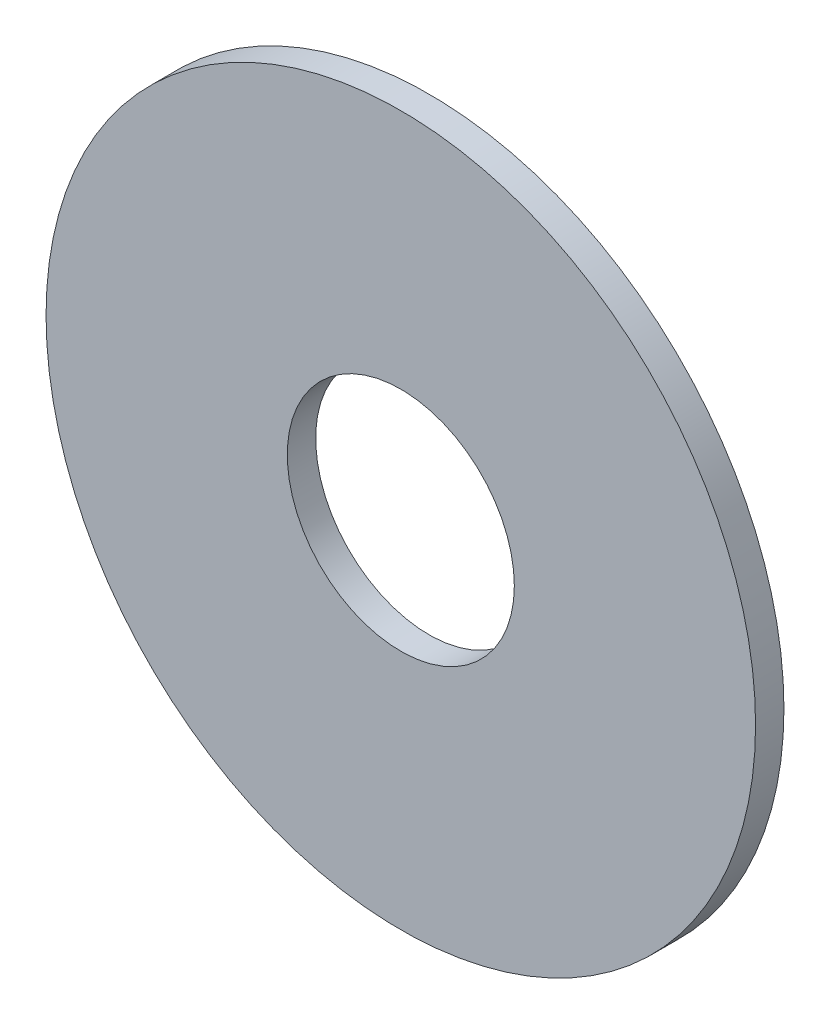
ISO-10303-21;
HEADER;
FILE_DESCRIPTION(('STEP AP214'),'2;1');
FILE_NAME('part.step','',(''),(''),'','','');
FILE_SCHEMA(('AUTOMOTIVE_DESIGN { 1 0 10303 214 1 1 1 1 }'));
ENDSEC;
DATA;
#1=APPLICATION_CONTEXT('core data for automotive mechanical design processes');
#2=APPLICATION_PROTOCOL_DEFINITION('international standard','automotive_design',2000,#1);
#3=PRODUCT_CONTEXT('',#1,'mechanical');
#4=PRODUCT('Part','Part','',(#3));
#5=PRODUCT_RELATED_PRODUCT_CATEGORY('part','',(#4));
#6=PRODUCT_DEFINITION_FORMATION('','',#4);
#7=PRODUCT_DEFINITION_CONTEXT('part definition',#1,'design');
#8=PRODUCT_DEFINITION('design','',#6,#7);
#9=PRODUCT_DEFINITION_SHAPE('','',#8);
#10=(LENGTH_UNIT() NAMED_UNIT(*) SI_UNIT(.MILLI.,.METRE.));
#11=(NAMED_UNIT(*) PLANE_ANGLE_UNIT() SI_UNIT($,.RADIAN.));
#12=(NAMED_UNIT(*) SI_UNIT($,.STERADIAN.) SOLID_ANGLE_UNIT());
#13=UNCERTAINTY_MEASURE_WITH_UNIT(LENGTH_MEASURE(1.E-05),#10,'distance_accuracy_value','');
#14=(GEOMETRIC_REPRESENTATION_CONTEXT(3) GLOBAL_UNCERTAINTY_ASSIGNED_CONTEXT((#13)) GLOBAL_UNIT_ASSIGNED_CONTEXT((#10,
#11,#12)) REPRESENTATION_CONTEXT('',''));
#15=CARTESIAN_POINT('',(0.,0.,0.));
#16=DIRECTION('',(0.,0.,1.));
#17=DIRECTION('',(1.,0.,0.));
#18=AXIS2_PLACEMENT_3D('',#15,#16,#17);
#19=CARTESIAN_POINT('',(0.,0.,-1.));
#20=DIRECTION('',(0.,0.,1.));
#21=DIRECTION('',(1.,0.,0.));
#22=AXIS2_PLACEMENT_3D('',#19,#20,#21);
#23=CYLINDRICAL_SURFACE('',#22,12.5);
#24=CARTESIAN_POINT('',(0.,0.,-1.));
#25=DIRECTION('',(0.,0.,1.));
#26=DIRECTION('',(1.,0.,0.));
#27=AXIS2_PLACEMENT_3D('',#24,#25,#26);
#28=CIRCLE('',#27,12.5);
#29=CARTESIAN_POINT('',(12.5,0.,-1.));
#30=VERTEX_POINT('',#29);
#31=EDGE_CURVE('E10',#30,#30,#28,.T.);
#32=ORIENTED_EDGE('',*,*,#31,.T.);
#33=EDGE_LOOP('',(#32));
#34=FACE_BOUND('',#33,.T.);
#35=CARTESIAN_POINT('',(0.,0.,0.));
#36=DIRECTION('',(0.,0.,1.));
#37=DIRECTION('',(1.,0.,0.));
#38=AXIS2_PLACEMENT_3D('',#35,#36,#37);
#39=CIRCLE('',#38,12.5);
#40=CARTESIAN_POINT('',(12.5,0.,0.));
#41=VERTEX_POINT('',#40);
#42=EDGE_CURVE('E34',#41,#41,#39,.T.);
#43=ORIENTED_EDGE('',*,*,#42,.F.);
#44=EDGE_LOOP('',(#43));
#45=FACE_BOUND('',#44,.T.);
#46=ADVANCED_FACE('F31',(#34,#45),#23,.T.);
#47=CARTESIAN_POINT('',(0.,0.,-1.));
#48=DIRECTION('',(0.,0.,1.));
#49=DIRECTION('',(1.,0.,0.));
#50=AXIS2_PLACEMENT_3D('',#47,#48,#49);
#51=PLANE('',#50);
#52=CARTESIAN_POINT('',(0.,0.,-1.));
#53=DIRECTION('',(0.,0.,1.));
#54=DIRECTION('',(1.,0.,0.));
#55=AXIS2_PLACEMENT_3D('',#52,#53,#54);
#56=CIRCLE('',#55,4.);
#57=CARTESIAN_POINT('',(4.,0.,-1.));
#58=VERTEX_POINT('',#57);
#59=EDGE_CURVE('E41',#58,#58,#56,.T.);
#60=ORIENTED_EDGE('',*,*,#59,.T.);
#61=EDGE_LOOP('',(#60));
#62=FACE_BOUND('',#61,.T.);
#63=ORIENTED_EDGE('',*,*,#31,.F.);
#64=EDGE_LOOP('',(#63));
#65=FACE_BOUND('',#64,.T.);
#66=ADVANCED_FACE('F49',(#62,#65),#51,.F.);
#67=CARTESIAN_POINT('',(0.,0.,0.));
#68=DIRECTION('',(0.,0.,1.));
#69=DIRECTION('',(1.,0.,0.));
#70=AXIS2_PLACEMENT_3D('',#67,#68,#69);
#71=PLANE('',#70);
#72=CARTESIAN_POINT('',(0.,0.,0.));
#73=DIRECTION('',(0.,0.,1.));
#74=DIRECTION('',(1.,0.,0.));
#75=AXIS2_PLACEMENT_3D('',#72,#73,#74);
#76=CIRCLE('',#75,4.);
#77=CARTESIAN_POINT('',(4.,0.,0.));
#78=VERTEX_POINT('',#77);
#79=EDGE_CURVE('E43',#78,#78,#76,.T.);
#80=ORIENTED_EDGE('',*,*,#79,.F.);
#81=EDGE_LOOP('',(#80));
#82=FACE_BOUND('',#81,.T.);
#83=ORIENTED_EDGE('',*,*,#42,.T.);
#84=EDGE_LOOP('',(#83));
#85=FACE_BOUND('',#84,.T.);
#86=ADVANCED_FACE('F55',(#82,#85),#71,.T.);
#87=CARTESIAN_POINT('',(0.,0.,-1.));
#88=DIRECTION('',(0.,0.,1.));
#89=DIRECTION('',(1.,0.,0.));
#90=AXIS2_PLACEMENT_3D('',#87,#88,#89);
#91=CYLINDRICAL_SURFACE('',#90,4.);
#92=ORIENTED_EDGE('',*,*,#59,.F.);
#93=EDGE_LOOP('',(#92));
#94=FACE_BOUND('',#93,.T.);
#95=ORIENTED_EDGE('',*,*,#79,.T.);
#96=EDGE_LOOP('',(#95));
#97=FACE_BOUND('',#96,.T.);
#98=ADVANCED_FACE('F52',(#94,#97),#91,.F.);
#99=CLOSED_SHELL('',(#46,#66,#86,#98));
#100=MANIFOLD_SOLID_BREP('B2',#99);
#101=ADVANCED_BREP_SHAPE_REPRESENTATION('',(#18,#100),#14);
#102=SHAPE_DEFINITION_REPRESENTATION(#9,#101);
ENDSEC;
END-ISO-10303-21;
